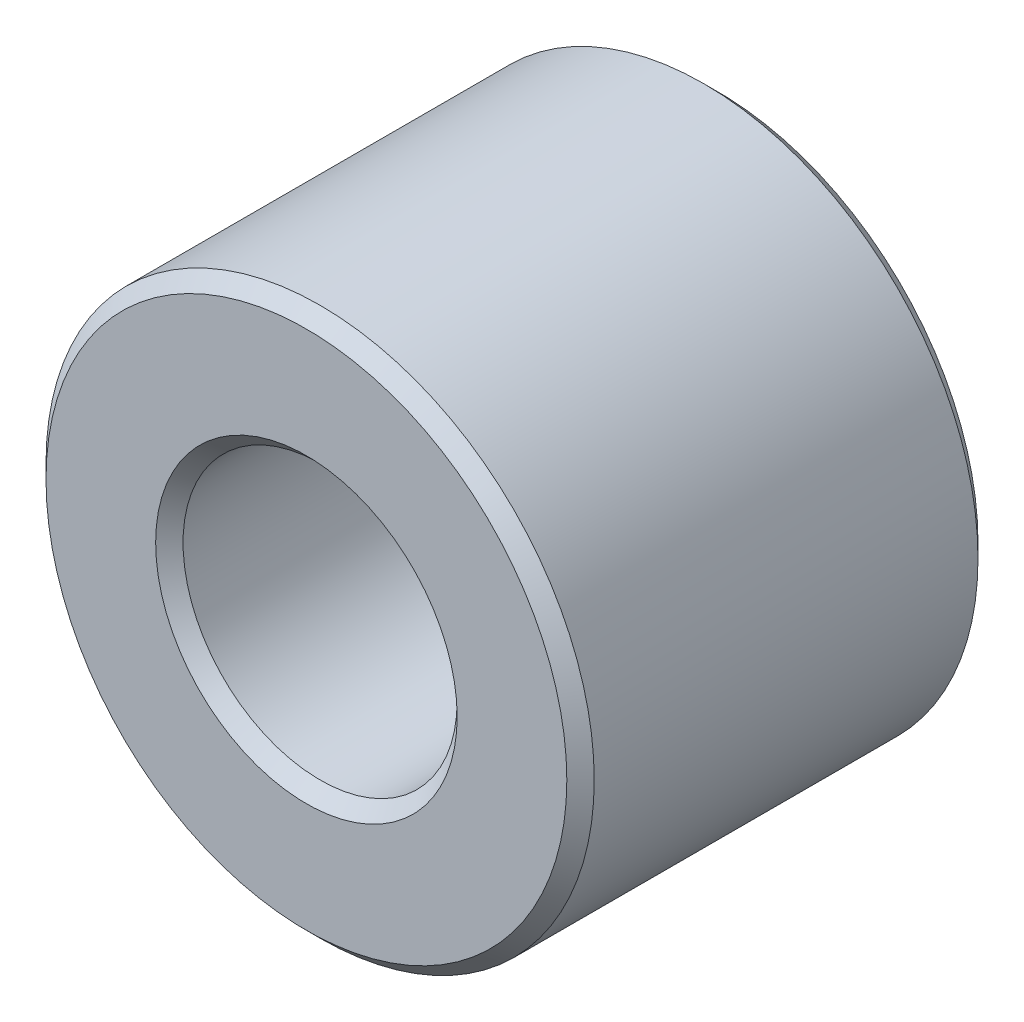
from build123d import *

# Parameters (mm, degrees)
SKETCH1_R           = 40
SKETCH1_R_2         = 20
BOSS_EXTRUDE1_DEPTH = 30
CHAMFER1_SIZE       = 2


with BuildPart() as part:
    # Sketch1 → Boss-Extrude1 (new, symmetric)
    with BuildSketch(Plane.XY):
        Circle(SKETCH1_R)
        Circle(SKETCH1_R_2, mode=Mode.SUBTRACT)
    extrude(amount=BOSS_EXTRUDE1_DEPTH, both=True)

    # Chamfer1
    chamfer1_edges = [part.edges().sort_by_distance(p)[0] for p in [
        (-40, 0, -30),
        (-40, 0, 30),
        (-20, 0, -30),
        (-20, 0, 30),
    ]]
    chamfer(chamfer1_edges, length=CHAMFER1_SIZE)


solid = part.part
